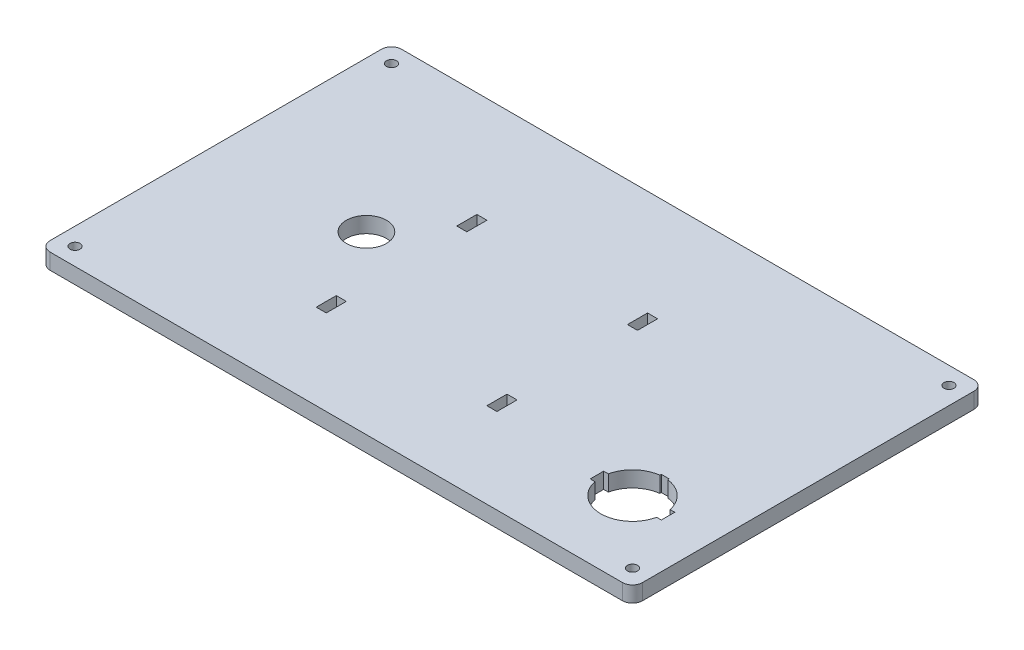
from build123d import *

# Parameters (mm, degrees)
SKETCH1_R           = 1.5875
BOSS_EXTRUDE1_DEPTH = 5
CUT_EXTRUDE1_REACH  = 111.018
SKETCH2_W           = 3.175
SKETCH2_H           = 6.35
CUT_EXTRUDE2_REACH  = 111.018
SKETCH3_R           = 6.35


with BuildPart() as part:
    # Sketch1 → Boss-Extrude1 (new body)
    with BuildSketch(Plane(origin=(0, 0, 0), x_dir=(1, 0, 0), z_dir=(0, 1, 0))):
        with BuildLine():
            Line((-90.4875, 55.5625), (90.4875, 55.5625))
            ThreePointArc((90.4875, 55.5625), (92.73256403, 54.63256403), (93.6625, 52.3875))
            Line((93.6625, 52.3875), (93.6625, -52.3875))
            ThreePointArc((93.6625, -52.3875), (92.73256403, -54.63256403), (90.4875, -55.5625))
            Line((90.4875, -55.5625), (-90.4875, -55.5625))
            ThreePointArc((-90.4875, -55.5625), (-92.73256403, -54.63256403), (-93.6625, -52.3875))
            Line((-93.6625, -52.3875), (-93.6625, 52.3875))
            ThreePointArc((-93.6625, 52.3875), (-92.73256403, 54.63256403), (-90.4875, 55.5625))
        make_face()
        with Locations(Location((-88.138, 50.038, 0), (0, 0, 270))):
            Circle(SKETCH1_R, mode=Mode.SUBTRACT)
        with Locations(Location((-88.138, -50.038, 0), (0, 0, 270))):
            Circle(SKETCH1_R, mode=Mode.SUBTRACT)
        with Locations(Location((88.138, -50.038, 0), (0, 0, 270))):
            Circle(SKETCH1_R, mode=Mode.SUBTRACT)
        with Locations(Location((88.138, 50.038, 0), (0, 0, 270))):
            Circle(SKETCH1_R, mode=Mode.SUBTRACT)
    extrude(amount=BOSS_EXTRUDE1_DEPTH)

    # Sketch2 → Cut-Extrude1 (cut, up to next)
    with BuildSketch(Plane(origin=(0, 5, 0), x_dir=(1, 0, 0), z_dir=(0, 1, 0)), mode=Mode.PRIVATE) as cut_extrude1_sk1:
        with Locations((22.225, -25.4)):
            Rectangle(SKETCH2_W, SKETCH2_H)
    cut_extrude1_tool1 = extrude(cut_extrude1_sk1.sketch, amount=-CUT_EXTRUDE1_REACH, mode=Mode.PRIVATE) & part.part
    # Sketch2 → Cut-Extrude1 (cut, up to next)
    with BuildSketch(Plane(origin=(0, 5, 0), x_dir=(1, 0, 0), z_dir=(0, 1, 0)), mode=Mode.PRIVATE) as cut_extrude1_sk2:
        with Locations((22.225, 19.05)):
            Rectangle(SKETCH2_W, SKETCH2_H)
    cut_extrude1_tool2 = extrude(cut_extrude1_sk2.sketch, amount=-CUT_EXTRUDE1_REACH, mode=Mode.PRIVATE) & part.part
    # Sketch2 → Cut-Extrude1 (cut, up to next)
    with BuildSketch(Plane(origin=(0, 5, 0), x_dir=(1, 0, 0), z_dir=(0, 1, 0)), mode=Mode.PRIVATE) as cut_extrude1_sk3:
        with Locations((-31.75, 19.05)):
            Rectangle(SKETCH2_W, SKETCH2_H)
    cut_extrude1_tool3 = extrude(cut_extrude1_sk3.sketch, amount=-CUT_EXTRUDE1_REACH, mode=Mode.PRIVATE) & part.part
    # Sketch2 → Cut-Extrude1 (cut, up to next)
    with BuildSketch(Plane(origin=(0, 5, 0), x_dir=(1, 0, 0), z_dir=(0, 1, 0)), mode=Mode.PRIVATE) as cut_extrude1_sk4:
        with Locations((-31.75, -25.4)):
            Rectangle(SKETCH2_W, SKETCH2_H)
    cut_extrude1_tool4 = extrude(cut_extrude1_sk4.sketch, amount=-CUT_EXTRUDE1_REACH, mode=Mode.PRIVATE) & part.part
    add(cut_extrude1_tool1.solids().sort_by_distance((22.225, 5, 25.4))[0], mode=Mode.SUBTRACT)
    add(cut_extrude1_tool2.solids().sort_by_distance((22.225, 5, -19.05))[0], mode=Mode.SUBTRACT)
    add(cut_extrude1_tool3.solids().sort_by_distance((-31.75, 5, -19.05))[0], mode=Mode.SUBTRACT)
    add(cut_extrude1_tool4.solids().sort_by_distance((-31.75, 5, 25.4))[0], mode=Mode.SUBTRACT)

    # Sketch3 → Cut-Extrude2 (cut, up to next)
    with BuildSketch(Plane(origin=(0, 5, 0), x_dir=(1, 0, 0), z_dir=(0, 1, 0)), mode=Mode.PRIVATE) as cut_extrude2_sk1:
        with Locations(Location((-46.0375, 0, 0), (0, 0, 270))):
            Circle(SKETCH3_R)
    cut_extrude2_tool1 = extrude(cut_extrude2_sk1.sketch, amount=-CUT_EXTRUDE2_REACH, mode=Mode.PRIVATE) & part.part
    # Sketch3 → Cut-Extrude2 (cut, up to next)
    with BuildSketch(Plane(origin=(0, 5, 0), x_dir=(1, 0, 0), z_dir=(0, 1, 0)), mode=Mode.PRIVATE) as cut_extrude2_sk2:
        with BuildLine():
            Line((58.490846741, -32.28721), (57.01284, -32.28721))
            Line((57.01284, -32.28721), (57.01284, -28.03779))
            Line((57.01284, -28.03779), (58.490846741, -28.03779))
            ThreePointArc((58.490846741, -28.03779), (61.512294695, -22.784537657), (67.01282, -20.240912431))
            Line((67.01282, -20.240912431), (67.01282, -19.7866))
            Line((67.01282, -19.7866), (69.51218, -19.7866))
            Line((69.51218, -19.7866), (69.51218, -20.240912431))
            ThreePointArc((69.51218, -20.240912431), (75.012705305, -22.784537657), (78.034153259, -28.03779))
            Line((78.034153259, -28.03779), (79.51216, -28.03779))
            Line((79.51216, -28.03779), (79.51216, -32.28721))
            Line((79.51216, -32.28721), (78.034153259, -32.28721))
            ThreePointArc((78.034153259, -32.28721), (68.2625, -40.16248), (58.490846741, -32.28721))
        make_face()
    cut_extrude2_tool2 = extrude(cut_extrude2_sk2.sketch, amount=-CUT_EXTRUDE2_REACH, mode=Mode.PRIVATE) & part.part
    add(cut_extrude2_tool1.solids().sort_by_distance((-46.0375, 5, 0))[0], mode=Mode.SUBTRACT)
    add(cut_extrude2_tool2.solids().sort_by_distance((68.2625, 5, 30.131183))[0], mode=Mode.SUBTRACT)


solid = part.part
